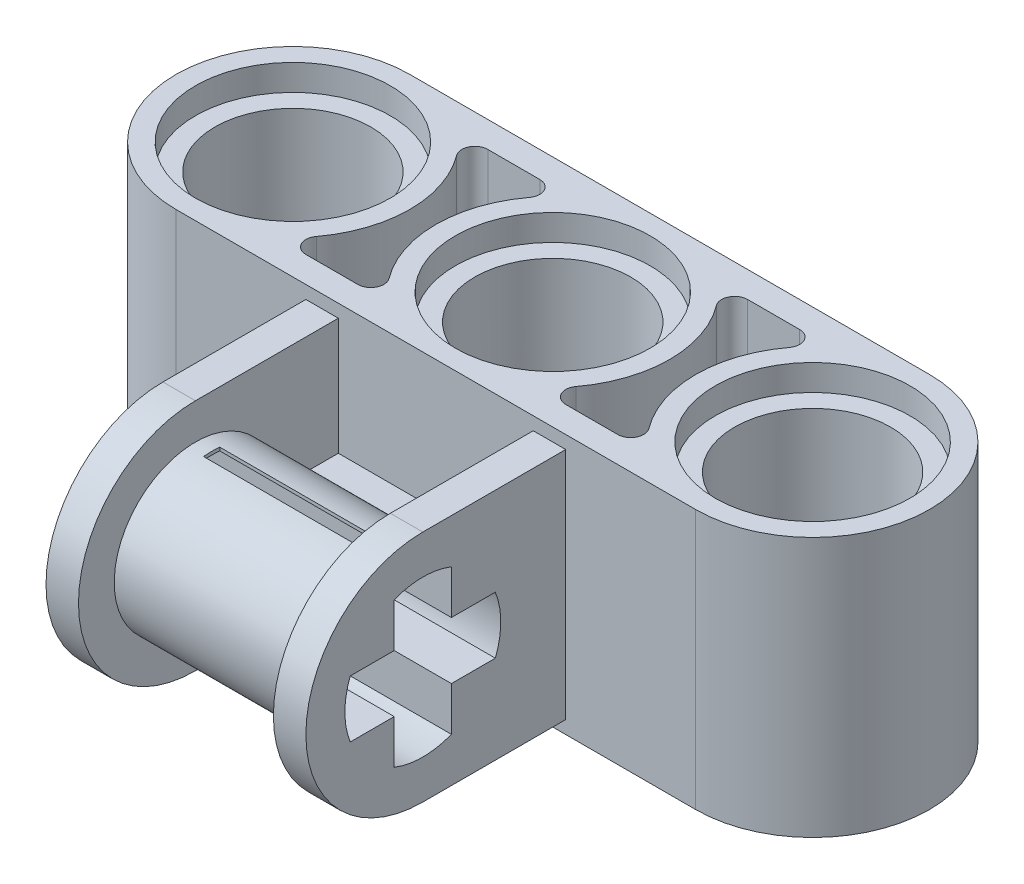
from build123d import *

# Parameters (mm, degrees)
SKETCH1_R                    = 2.4
BOSS_EXTRUDE1_DEPTH          = 8
SKETCH6_R                    = 3
CUT_EXTRUDE4_DEPTH           = 0.8
CUT_EXTRUDE5_START           = -3.2
CUT_EXTRUDE5_DEPTH           = 3.2
CUT_EXTRUDE6_DEPTH           = 8
BOSS_EXTRUDE4_DEPTH          = 4
BOSS_EXTRUDE4_DEPTH_BACK     = 4
CUT_EXTRUDE_THIN1_DEPTH      = 3
CUT_EXTRUDE_THIN1_DEPTH_BACK = 3
CUT_EXTRUDE11_DEPTH          = 22.02189335
CUT_EXTRUDE15_DEPTH          = 3
CUT_EXTRUDE15_DEPTH_BACK     = 3
CUT_EXTRUDE16_DEPTH          = 10
CUT_EXTRUDE16_DEPTH_BACK     = 10
SKETCH16_W                   = 5
SKETCH16_H                   = 0.5


with BuildPart() as part:
    # Sketch1 → Boss-Extrude1 (new body)
    with BuildSketch(Plane(origin=(0, 0, 0), x_dir=(1, 0, 0), z_dir=(0, 1, 0))):
        with BuildLine():
            Line((0, 3.6), (32, 3.6))
            ThreePointArc((32, 3.6), (35.6, 0), (32, -3.6))
            Line((32, -3.6), (0, -3.6))
            ThreePointArc((0, -3.6), (-3.6, 0), (0, 3.6))
        make_face()
        with Locations(Location((0, 0, 0), (0, 0, 270))):
            Circle(SKETCH1_R, mode=Mode.SUBTRACT)
        with Locations(Location((8, 0, 0), (0, 0, 270))):
            Circle(SKETCH1_R, mode=Mode.SUBTRACT)
        with Locations(Location((16, 0, 0), (0, 0, 270))):
            Circle(SKETCH1_R, mode=Mode.SUBTRACT)
        with Locations(Location((24, 0, 0), (0, 0, 270))):
            Circle(SKETCH1_R, mode=Mode.SUBTRACT)
        with Locations(Location((32, 0, 0), (0, 0, 270))):
            Circle(SKETCH1_R, mode=Mode.SUBTRACT)
    extrude(amount=BOSS_EXTRUDE1_DEPTH)

    # Sketch6 → Cut-Extrude4 (cut)
    with BuildSketch(Plane(origin=(0, 8, 0), x_dir=(1, 0, 0), z_dir=(0, 1, 0))):
        with Locations(Location((0, 0, 0), (0, 0, 270))):
            Circle(SKETCH6_R)
        with Locations(Location((8, 0, 0), (0, 0, 270))):
            Circle(SKETCH6_R)
        with Locations(Location((16, 0, 0), (0, 0, 270))):
            Circle(SKETCH6_R)
        with Locations(Location((24, 0, 0), (0, 0, 270))):
            Circle(SKETCH6_R)
        with Locations(Location((32, 0, 0), (0, 0, 270))):
            Circle(SKETCH6_R)
    cut_extrude4 = extrude(amount=-CUT_EXTRUDE4_DEPTH, mode=Mode.SUBTRACT)

    # Sketch7 → Cut-Extrude5 (cut)
    with BuildSketch(Plane(origin=(0, 8, 0), x_dir=(1, 0, 0), z_dir=(0, 1, 0)).offset(CUT_EXTRUDE5_START)):
        with BuildLine():
            Line((3.2, 2.8), (4.8, 2.8))
            ThreePointArc((4.8, 2.8), (5.157770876, 2.578885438), (5.12, 2.16))
            ThreePointArc((5.12, 2.16), (4.4, 0), (5.12, -2.16))
            ThreePointArc((5.12, -2.16), (5.157770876, -2.578885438), (4.8, -2.8))
            Line((4.8, -2.8), (3.2, -2.8))
            ThreePointArc((3.2, -2.8), (2.842229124, -2.578885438), (2.88, -2.16))
            ThreePointArc((2.88, -2.16), (3.6, 0), (2.88, 2.16))
            ThreePointArc((2.88, 2.16), (2.842229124, 2.578885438), (3.2, 2.8))
        make_face()
        with BuildLine():
            Line((11.2, 2.8), (12.8, 2.8))
            ThreePointArc((12.8, 2.8), (13.157770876, 2.578885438), (13.12, 2.16))
            ThreePointArc((13.12, 2.16), (12.4, 0), (13.12, -2.16))
            ThreePointArc((13.12, -2.16), (13.157770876, -2.578885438), (12.8, -2.8))
            Line((12.8, -2.8), (11.2, -2.8))
            ThreePointArc((11.2, -2.8), (10.842229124, -2.578885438), (10.88, -2.16))
            ThreePointArc((10.88, -2.16), (11.6, 0), (10.88, 2.16))
            ThreePointArc((10.88, 2.16), (10.842229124, 2.578885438), (11.2, 2.8))
        make_face()
        with BuildLine():
            Line((19.2, 2.8), (20.8, 2.8))
            ThreePointArc((20.8, 2.8), (21.157770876, 2.578885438), (21.12, 2.16))
            ThreePointArc((21.12, 2.16), (20.4, 0), (21.12, -2.16))
            ThreePointArc((21.12, -2.16), (21.157770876, -2.578885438), (20.8, -2.8))
            Line((20.8, -2.8), (19.2, -2.8))
            ThreePointArc((19.2, -2.8), (18.842229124, -2.578885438), (18.88, -2.16))
            ThreePointArc((18.88, -2.16), (19.6, 0), (18.88, 2.16))
            ThreePointArc((18.88, 2.16), (18.842229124, 2.578885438), (19.2, 2.8))
        make_face()
        with BuildLine():
            Line((27.2, 2.8), (28.8, 2.8))
            ThreePointArc((28.8, 2.8), (29.157770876, 2.578885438), (29.12, 2.16))
            ThreePointArc((29.12, 2.16), (28.4, 0), (29.12, -2.16))
            ThreePointArc((29.12, -2.16), (29.157770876, -2.578885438), (28.8, -2.8))
            Line((28.8, -2.8), (27.2, -2.8))
            ThreePointArc((27.2, -2.8), (26.842229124, -2.578885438), (26.88, -2.16))
            ThreePointArc((26.88, -2.16), (27.6, 0), (26.88, 2.16))
            ThreePointArc((26.88, 2.16), (26.842229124, 2.578885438), (27.2, 2.8))
        make_face()
    cut_extrude5 = extrude(amount=CUT_EXTRUDE5_DEPTH, mode=Mode.SUBTRACT)

    # Mirror2: Cut-Extrude4, Cut-Extrude5 across plane
    add(cut_extrude4.mirror(Plane.ZX.offset(4)), mode=Mode.SUBTRACT)
    add(cut_extrude5.mirror(Plane.ZX.offset(4)), mode=Mode.SUBTRACT)

    # Sketch8 → Cut-Extrude6 (cut)
    with BuildSketch(Plane.XZ):
        with BuildLine():
            Line((24, 3.6), (32, 3.6))
            ThreePointArc((32, 3.6), (35.6, 0), (32, -3.6))
            Line((32, -3.6), (24, -3.6))
            Line((24, -3.6), (16, -3.6))
            ThreePointArc((16, -3.6), (19.6, 0), (16, 3.6))
            Line((16, 3.6), (24, 3.6))
        make_face()
    extrude(amount=-CUT_EXTRUDE6_DEPTH, mode=Mode.SUBTRACT)

    # Sketch12 → Boss-Extrude4 (add, two sides: drawn at the far end of the back side and taken through both)
    with BuildSketch(Plane(origin=(8, 0, 0), x_dir=(0, 0, -1), z_dir=(1, 0, 0)).offset(-BOSS_EXTRUDE4_DEPTH_BACK)):
        with BuildLine():
            Line((-8, 7.6), (-3.6, 7.6))
            Line((-3.6, 7.6), (-3.6, 0.4))
            Line((-3.6, 0.4), (-8, 0.4))
            ThreePointArc((-8, 0.4), (-11.6, 4), (-8, 7.6))
        make_face()
    extrude(amount=BOSS_EXTRUDE4_DEPTH + BOSS_EXTRUDE4_DEPTH_BACK)

    # Sketch10 → Cut-Extrude-Thin1 (cut, two sides: drawn at the far end of the back side and taken through both)
    with BuildSketch(Plane(origin=(8, 0, 0), x_dir=(0, 0, -1), z_dir=(1, 0, 0)).offset(-CUT_EXTRUDE_THIN1_DEPTH_BACK)):
        with BuildLine():
            Line((-3.749016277, 1.5), (-8, 1.5))
            ThreePointArc((-8, 1.5), (-10.5, 4), (-8, 6.5))
            Line((-8, 6.5), (-3.749016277, 6.5))
            Line((-3.749016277, 6.5), (-3.749016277, 10.5))
            Line((-3.749016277, 10.5), (-8, 10.5))
            ThreePointArc((-8, 10.5), (-14.5, 4), (-8, -2.5))
            Line((-8, -2.5), (-3.749016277, -2.5))
            Line((-3.749016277, -2.5), (-3.749016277, 1.5))
        make_face()
    extrude(amount=CUT_EXTRUDE_THIN1_DEPTH + CUT_EXTRUDE_THIN1_DEPTH_BACK, mode=Mode.SUBTRACT)

    # Sketch13 → Cut-Extrude11 (cut, through all)
    with BuildSketch(Plane.ZY.offset(-4)):
        with BuildLine():
            Line((10.232845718, 4.88), (8.88, 4.88))
            Line((8.88, 4.88), (8.88, 6.232845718))
            ThreePointArc((8.88, 6.232845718), (8, 6.4), (7.12, 6.232845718))
            Line((7.12, 6.232845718), (7.12, 4.88))
            Line((7.12, 4.88), (5.767154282, 4.88))
            ThreePointArc((5.767154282, 4.88), (5.6, 4), (5.767154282, 3.12))
            Line((5.767154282, 3.12), (7.12, 3.12))
            Line((7.12, 3.12), (7.12, 1.767154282))
            ThreePointArc((7.12, 1.767154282), (8, 1.6), (8.88, 1.767154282))
            Line((8.88, 1.767154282), (8.88, 3.12))
            Line((8.88, 3.12), (10.232845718, 3.12))
            ThreePointArc((10.232845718, 3.12), (10.4, 4), (10.232845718, 4.88))
        make_face()
    extrude(amount=-CUT_EXTRUDE11_DEPTH, mode=Mode.SUBTRACT)

    # Sketch15 → Cut-Extrude15 (cut, two sides: drawn at the far end of the back side and taken through both)
    with BuildSketch(Plane(origin=(8, 0, 0), x_dir=(0, 0, -1), z_dir=(1, 0, 0)).offset(-CUT_EXTRUDE15_DEPTH_BACK)):
        with BuildLine():
            Line((-8, 7.977638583), (-8, 6.5))
            ThreePointArc((-8, 6.5), (-6.232233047, 5.767766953), (-5.5, 4))
            Line((-5.5, 4), (-3.6, 4))
            Line((-3.6, 4), (-3.6, 7.977638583))
            Line((-3.6, 7.977638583), (-8, 7.977638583))
        make_face()
    extrude(amount=CUT_EXTRUDE15_DEPTH + CUT_EXTRUDE15_DEPTH_BACK, mode=Mode.SUBTRACT)

    # Sketch16 → Cut-Extrude16 (cut, two sides: drawn at the far end of the back side and taken through both)
    with BuildSketch(Plane(origin=(0, 4, 0), x_dir=(1, 0, 0), z_dir=(0, 1, 0)).offset(-CUT_EXTRUDE16_DEPTH_BACK)):
        with Locations((8, -8)):
            Rectangle(SKETCH16_W, SKETCH16_H)
    extrude(amount=CUT_EXTRUDE16_DEPTH + CUT_EXTRUDE16_DEPTH_BACK, mode=Mode.SUBTRACT)


solid = part.part
